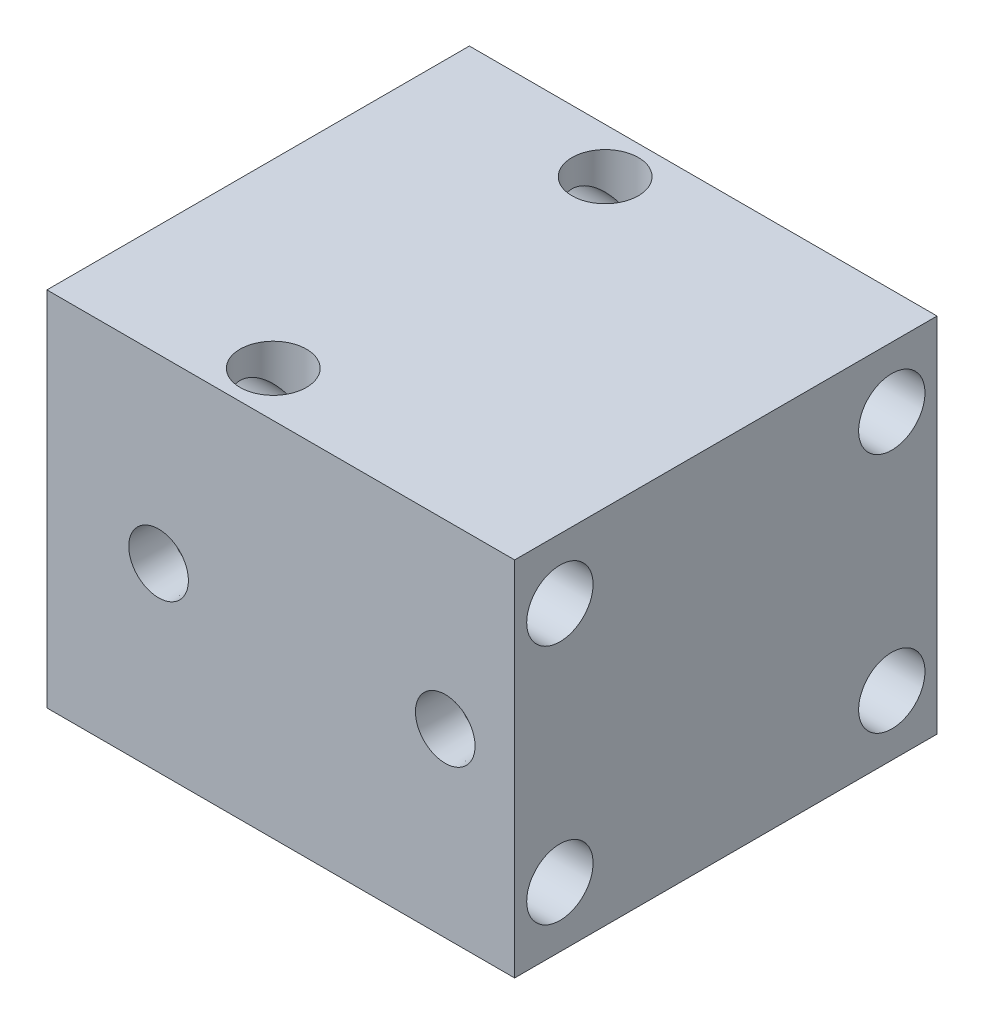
ISO-10303-21;
HEADER;
FILE_DESCRIPTION(('STEP AP214'),'2;1');
FILE_NAME('part.step','',(''),(''),'','','');
FILE_SCHEMA(('AUTOMOTIVE_DESIGN { 1 0 10303 214 1 1 1 1 }'));
ENDSEC;
DATA;
#1=APPLICATION_CONTEXT('core data for automotive mechanical design processes');
#2=APPLICATION_PROTOCOL_DEFINITION('international standard','automotive_design',2000,#1);
#3=PRODUCT_CONTEXT('',#1,'mechanical');
#4=PRODUCT('Part','Part','',(#3));
#5=PRODUCT_RELATED_PRODUCT_CATEGORY('part','',(#4));
#6=PRODUCT_DEFINITION_FORMATION('','',#4);
#7=PRODUCT_DEFINITION_CONTEXT('part definition',#1,'design');
#8=PRODUCT_DEFINITION('design','',#6,#7);
#9=PRODUCT_DEFINITION_SHAPE('','',#8);
#10=(LENGTH_UNIT() NAMED_UNIT(*) SI_UNIT(.MILLI.,.METRE.));
#11=(NAMED_UNIT(*) PLANE_ANGLE_UNIT() SI_UNIT($,.RADIAN.));
#12=(NAMED_UNIT(*) SI_UNIT($,.STERADIAN.) SOLID_ANGLE_UNIT());
#13=UNCERTAINTY_MEASURE_WITH_UNIT(LENGTH_MEASURE(1.E-05),#10,'distance_accuracy_value','');
#14=(GEOMETRIC_REPRESENTATION_CONTEXT(3) GLOBAL_UNCERTAINTY_ASSIGNED_CONTEXT((#13)) GLOBAL_UNIT_ASSIGNED_CONTEXT((#10,
#11,#12)) REPRESENTATION_CONTEXT('',''));
#15=CARTESIAN_POINT('',(0.,0.,0.));
#16=DIRECTION('',(0.,0.,1.));
#17=DIRECTION('',(1.,0.,0.));
#18=AXIS2_PLACEMENT_3D('',#15,#16,#17);
#19=CARTESIAN_POINT('',(-17.5,120.,55.));
#20=DIRECTION('',(0.,-1.,0.));
#21=DIRECTION('',(0.,0.,-1.));
#22=AXIS2_PLACEMENT_3D('',#19,#20,#21);
#23=CYLINDRICAL_SURFACE('',#22,11.);
#24=CARTESIAN_POINT('',(-17.5,20.,55.));
#25=DIRECTION('',(-0.707106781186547,-0.707106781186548,0.));
#26=DIRECTION('',(0.707106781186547,-0.707106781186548,0.));
#27=AXIS2_PLACEMENT_3D('',#24,#25,#26);
#28=ELLIPSE('',#27,15.556349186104,11.);
#29=CARTESIAN_POINT('',(-17.5,20.,44.));
#30=VERTEX_POINT('',#29);
#31=CARTESIAN_POINT('',(-17.5,20.,66.));
#32=VERTEX_POINT('',#31);
#33=EDGE_CURVE('E11',#30,#32,#28,.F.);
#34=ORIENTED_EDGE('',*,*,#33,.F.);
#35=CARTESIAN_POINT('',(-17.5,20.,55.));
#36=DIRECTION('',(0.707106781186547,-0.707106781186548,0.));
#37=DIRECTION('',(-0.707106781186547,-0.707106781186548,0.));
#38=AXIS2_PLACEMENT_3D('',#35,#36,#37);
#39=ELLIPSE('',#38,15.556349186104,11.);
#40=EDGE_CURVE('E51',#32,#30,#39,.F.);
#41=ORIENTED_EDGE('',*,*,#40,.F.);
#42=EDGE_LOOP('',(#34,#41));
#43=FACE_BOUND('',#42,.T.);
#44=CARTESIAN_POINT('',(-17.5,100.,55.));
#45=DIRECTION('',(-0.707106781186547,-0.707106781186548,0.));
#46=DIRECTION('',(0.707106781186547,-0.707106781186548,0.));
#47=AXIS2_PLACEMENT_3D('',#44,#45,#46);
#48=ELLIPSE('',#47,15.556349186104,11.);
#49=CARTESIAN_POINT('',(-17.5,100.,44.));
#50=VERTEX_POINT('',#49);
#51=CARTESIAN_POINT('',(-17.5,100.,66.));
#52=VERTEX_POINT('',#51);
#53=EDGE_CURVE('E252',#50,#52,#48,.T.);
#54=ORIENTED_EDGE('',*,*,#53,.F.);
#55=CARTESIAN_POINT('',(-17.5,100.,55.));
#56=DIRECTION('',(0.707106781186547,-0.707106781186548,0.));
#57=DIRECTION('',(-0.707106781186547,-0.707106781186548,0.));
#58=AXIS2_PLACEMENT_3D('',#55,#56,#57);
#59=ELLIPSE('',#58,15.556349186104,11.);
#60=EDGE_CURVE('E250',#52,#50,#59,.T.);
#61=ORIENTED_EDGE('',*,*,#60,.F.);
#62=EDGE_LOOP('',(#54,#61));
#63=FACE_BOUND('',#62,.T.);
#64=ADVANCED_FACE('F35',(#43,#63),#23,.F.);
#65=CARTESIAN_POINT('',(-17.5,100.,55.));
#66=DIRECTION('',(-0.707106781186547,-0.707106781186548,0.));
#67=DIRECTION('',(0.707106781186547,-0.707106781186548,0.));
#68=AXIS2_PLACEMENT_3D('',#65,#66,#67);
#69=ELLIPSE('',#68,15.556349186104,11.);
#70=EDGE_CURVE('E112',#50,#52,#69,.F.);
#71=ORIENTED_EDGE('',*,*,#70,.F.);
#72=CARTESIAN_POINT('',(-17.5,100.,55.));
#73=DIRECTION('',(0.707106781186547,-0.707106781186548,0.));
#74=DIRECTION('',(-0.707106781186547,-0.707106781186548,0.));
#75=AXIS2_PLACEMENT_3D('',#72,#73,#74);
#76=ELLIPSE('',#75,15.556349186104,11.);
#77=EDGE_CURVE('E58',#52,#50,#76,.F.);
#78=ORIENTED_EDGE('',*,*,#77,.F.);
#79=EDGE_LOOP('',(#71,#78));
#80=FACE_BOUND('',#79,.T.);
#81=CARTESIAN_POINT('',(-17.5,120.,55.));
#82=DIRECTION('',(0.,1.,0.));
#83=DIRECTION('',(0.,0.,1.));
#84=AXIS2_PLACEMENT_3D('',#81,#82,#83);
#85=CIRCLE('',#84,11.);
#86=CARTESIAN_POINT('',(-17.5,120.,66.));
#87=VERTEX_POINT('',#86);
#88=EDGE_CURVE('E186',#87,#87,#85,.T.);
#89=ORIENTED_EDGE('',*,*,#88,.T.);
#90=EDGE_LOOP('',(#89));
#91=FACE_BOUND('',#90,.T.);
#92=ADVANCED_FACE('F307',(#80,#91),#23,.F.);
#93=CARTESIAN_POINT('',(-17.5,120.,-55.));
#94=DIRECTION('',(0.,-1.,0.));
#95=DIRECTION('',(0.,0.,-1.));
#96=AXIS2_PLACEMENT_3D('',#93,#94,#95);
#97=CYLINDRICAL_SURFACE('',#96,11.);
#98=CARTESIAN_POINT('',(-17.5,20.,-55.));
#99=DIRECTION('',(-0.707106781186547,-0.707106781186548,0.));
#100=DIRECTION('',(0.707106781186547,-0.707106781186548,0.));
#101=AXIS2_PLACEMENT_3D('',#98,#99,#100);
#102=ELLIPSE('',#101,15.556349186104,11.);
#103=CARTESIAN_POINT('',(-17.5,20.,-66.));
#104=VERTEX_POINT('',#103);
#105=CARTESIAN_POINT('',(-17.5,20.,-44.));
#106=VERTEX_POINT('',#105);
#107=EDGE_CURVE('E246',#104,#106,#102,.F.);
#108=ORIENTED_EDGE('',*,*,#107,.F.);
#109=CARTESIAN_POINT('',(-17.5,20.,-55.));
#110=DIRECTION('',(0.707106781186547,-0.707106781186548,0.));
#111=DIRECTION('',(-0.707106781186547,-0.707106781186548,0.));
#112=AXIS2_PLACEMENT_3D('',#109,#110,#111);
#113=ELLIPSE('',#112,15.556349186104,11.);
#114=EDGE_CURVE('E238',#106,#104,#113,.F.);
#115=ORIENTED_EDGE('',*,*,#114,.F.);
#116=EDGE_LOOP('',(#108,#115));
#117=FACE_BOUND('',#116,.T.);
#118=CARTESIAN_POINT('',(-17.5,100.,-55.));
#119=DIRECTION('',(-0.707106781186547,-0.707106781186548,0.));
#120=DIRECTION('',(0.707106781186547,-0.707106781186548,0.));
#121=AXIS2_PLACEMENT_3D('',#118,#119,#120);
#122=ELLIPSE('',#121,15.556349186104,11.);
#123=CARTESIAN_POINT('',(-17.5,100.,-66.));
#124=VERTEX_POINT('',#123);
#125=CARTESIAN_POINT('',(-17.5,100.,-44.));
#126=VERTEX_POINT('',#125);
#127=EDGE_CURVE('E232',#124,#126,#122,.T.);
#128=ORIENTED_EDGE('',*,*,#127,.F.);
#129=CARTESIAN_POINT('',(-17.5,100.,-55.));
#130=DIRECTION('',(0.707106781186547,-0.707106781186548,0.));
#131=DIRECTION('',(-0.707106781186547,-0.707106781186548,0.));
#132=AXIS2_PLACEMENT_3D('',#129,#130,#131);
#133=ELLIPSE('',#132,15.556349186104,11.);
#134=EDGE_CURVE('E230',#126,#124,#133,.T.);
#135=ORIENTED_EDGE('',*,*,#134,.F.);
#136=EDGE_LOOP('',(#128,#135));
#137=FACE_BOUND('',#136,.T.);
#138=ADVANCED_FACE('F312',(#117,#137),#97,.F.);
#139=CARTESIAN_POINT('',(-17.5,100.,-55.));
#140=DIRECTION('',(-0.707106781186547,-0.707106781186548,0.));
#141=DIRECTION('',(0.707106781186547,-0.707106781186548,0.));
#142=AXIS2_PLACEMENT_3D('',#139,#140,#141);
#143=ELLIPSE('',#142,15.556349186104,11.);
#144=EDGE_CURVE('E235',#124,#126,#143,.F.);
#145=ORIENTED_EDGE('',*,*,#144,.F.);
#146=CARTESIAN_POINT('',(-17.5,100.,-55.));
#147=DIRECTION('',(0.707106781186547,-0.707106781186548,0.));
#148=DIRECTION('',(-0.707106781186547,-0.707106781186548,0.));
#149=AXIS2_PLACEMENT_3D('',#146,#147,#148);
#150=ELLIPSE('',#149,15.556349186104,11.);
#151=EDGE_CURVE('E227',#126,#124,#150,.F.);
#152=ORIENTED_EDGE('',*,*,#151,.F.);
#153=EDGE_LOOP('',(#145,#152));
#154=FACE_BOUND('',#153,.T.);
#155=CARTESIAN_POINT('',(-17.5,120.,-55.));
#156=DIRECTION('',(0.,1.,0.));
#157=DIRECTION('',(0.,0.,1.));
#158=AXIS2_PLACEMENT_3D('',#155,#156,#157);
#159=CIRCLE('',#158,11.);
#160=CARTESIAN_POINT('',(-17.5,120.,-44.));
#161=VERTEX_POINT('',#160);
#162=EDGE_CURVE('E192',#161,#161,#159,.T.);
#163=ORIENTED_EDGE('',*,*,#162,.T.);
#164=EDGE_LOOP('',(#163));
#165=FACE_BOUND('',#164,.T.);
#166=ADVANCED_FACE('F325',(#154,#165),#97,.F.);
#167=CARTESIAN_POINT('',(-77.5,120.,70.));
#168=DIRECTION('',(0.,1.,0.));
#169=DIRECTION('',(0.,0.,1.));
#170=AXIS2_PLACEMENT_3D('',#167,#168,#169);
#171=PLANE('',#170);
#172=ORIENTED_EDGE('',*,*,#162,.F.);
#173=EDGE_LOOP('',(#172));
#174=FACE_BOUND('',#173,.T.);
#175=DIRECTION('',(0.,0.,1.));
#176=VECTOR('',#175,1.);
#177=CARTESIAN_POINT('',(-77.5,120.,-70.));
#178=LINE('',#177,#176);
#179=CARTESIAN_POINT('',(-77.5,120.,-70.));
#180=VERTEX_POINT('',#179);
#181=CARTESIAN_POINT('',(-77.5,120.,70.));
#182=VERTEX_POINT('',#181);
#183=EDGE_CURVE('E198',#180,#182,#178,.T.);
#184=ORIENTED_EDGE('',*,*,#183,.T.);
#185=DIRECTION('',(1.,0.,0.));
#186=VECTOR('',#185,1.);
#187=CARTESIAN_POINT('',(-77.5,120.,70.));
#188=LINE('',#187,#186);
#189=CARTESIAN_POINT('',(77.5,120.,70.));
#190=VERTEX_POINT('',#189);
#191=EDGE_CURVE('E201',#182,#190,#188,.T.);
#192=ORIENTED_EDGE('',*,*,#191,.T.);
#193=DIRECTION('',(0.,0.,-1.));
#194=VECTOR('',#193,1.);
#195=CARTESIAN_POINT('',(77.5,120.,-70.));
#196=LINE('',#195,#194);
#197=CARTESIAN_POINT('',(77.5,120.,-70.));
#198=VERTEX_POINT('',#197);
#199=EDGE_CURVE('E204',#190,#198,#196,.T.);
#200=ORIENTED_EDGE('',*,*,#199,.T.);
#201=DIRECTION('',(-1.,0.,0.));
#202=VECTOR('',#201,1.);
#203=CARTESIAN_POINT('',(-77.5,120.,-70.));
#204=LINE('',#203,#202);
#205=EDGE_CURVE('E206',#198,#180,#204,.T.);
#206=ORIENTED_EDGE('',*,*,#205,.T.);
#207=EDGE_LOOP('',(#184,#192,#200,#206));
#208=FACE_BOUND('',#207,.T.);
#209=ORIENTED_EDGE('',*,*,#88,.F.);
#210=EDGE_LOOP('',(#209));
#211=FACE_BOUND('',#210,.T.);
#212=ADVANCED_FACE('F295',(#174,#208,#211),#171,.T.);
#213=CARTESIAN_POINT('',(-77.5,0.,70.));
#214=DIRECTION('',(0.,1.,0.));
#215=DIRECTION('',(0.,0.,1.));
#216=AXIS2_PLACEMENT_3D('',#213,#214,#215);
#217=PLANE('',#216);
#218=CARTESIAN_POINT('',(-17.5,0.,-55.));
#219=DIRECTION('',(0.,1.,0.));
#220=DIRECTION('',(0.,0.,1.));
#221=AXIS2_PLACEMENT_3D('',#218,#219,#220);
#222=CIRCLE('',#221,11.);
#223=CARTESIAN_POINT('',(-17.5,0.,-44.));
#224=VERTEX_POINT('',#223);
#225=EDGE_CURVE('E189',#224,#224,#222,.T.);
#226=ORIENTED_EDGE('',*,*,#225,.T.);
#227=EDGE_LOOP('',(#226));
#228=FACE_BOUND('',#227,.T.);
#229=DIRECTION('',(0.,0.,1.));
#230=VECTOR('',#229,1.);
#231=CARTESIAN_POINT('',(-77.5,0.,-70.));
#232=LINE('',#231,#230);
#233=CARTESIAN_POINT('',(-77.5,0.,-70.));
#234=VERTEX_POINT('',#233);
#235=CARTESIAN_POINT('',(-77.5,0.,70.));
#236=VERTEX_POINT('',#235);
#237=EDGE_CURVE('E195',#234,#236,#232,.T.);
#238=ORIENTED_EDGE('',*,*,#237,.F.);
#239=DIRECTION('',(-1.,0.,0.));
#240=VECTOR('',#239,1.);
#241=CARTESIAN_POINT('',(-77.5,0.,-70.));
#242=LINE('',#241,#240);
#243=CARTESIAN_POINT('',(77.5,0.,-70.));
#244=VERTEX_POINT('',#243);
#245=EDGE_CURVE('E202',#244,#234,#242,.T.);
#246=ORIENTED_EDGE('',*,*,#245,.F.);
#247=DIRECTION('',(0.,0.,-1.));
#248=VECTOR('',#247,1.);
#249=CARTESIAN_POINT('',(77.5,0.,-70.));
#250=LINE('',#249,#248);
#251=CARTESIAN_POINT('',(77.5,0.,70.));
#252=VERTEX_POINT('',#251);
#253=EDGE_CURVE('E213',#252,#244,#250,.T.);
#254=ORIENTED_EDGE('',*,*,#253,.F.);
#255=DIRECTION('',(1.,0.,0.));
#256=VECTOR('',#255,1.);
#257=CARTESIAN_POINT('',(-77.5,0.,70.));
#258=LINE('',#257,#256);
#259=EDGE_CURVE('E211',#236,#252,#258,.T.);
#260=ORIENTED_EDGE('',*,*,#259,.F.);
#261=EDGE_LOOP('',(#238,#246,#254,#260));
#262=FACE_BOUND('',#261,.T.);
#263=CARTESIAN_POINT('',(-17.5,0.,55.));
#264=DIRECTION('',(0.,1.,0.));
#265=DIRECTION('',(0.,0.,1.));
#266=AXIS2_PLACEMENT_3D('',#263,#264,#265);
#267=CIRCLE('',#266,11.);
#268=CARTESIAN_POINT('',(-17.5,0.,66.));
#269=VERTEX_POINT('',#268);
#270=EDGE_CURVE('E183',#269,#269,#267,.T.);
#271=ORIENTED_EDGE('',*,*,#270,.T.);
#272=EDGE_LOOP('',(#271));
#273=FACE_BOUND('',#272,.T.);
#274=ADVANCED_FACE('F289',(#228,#262,#273),#217,.F.);
#275=CARTESIAN_POINT('',(-77.5,120.,-70.));
#276=DIRECTION('',(1.,0.,0.));
#277=DIRECTION('',(0.,0.,-1.));
#278=AXIS2_PLACEMENT_3D('',#275,#276,#277);
#279=PLANE('',#278);
#280=CARTESIAN_POINT('',(-77.5,20.,55.));
#281=DIRECTION('',(-1.,0.,0.));
#282=DIRECTION('',(0.,0.,1.));
#283=AXIS2_PLACEMENT_3D('',#280,#281,#282);
#284=CIRCLE('',#283,11.);
#285=CARTESIAN_POINT('',(-77.5,20.,66.));
#286=VERTEX_POINT('',#285);
#287=EDGE_CURVE('E120',#286,#286,#284,.T.);
#288=ORIENTED_EDGE('',*,*,#287,.F.);
#289=EDGE_LOOP('',(#288));
#290=FACE_BOUND('',#289,.T.);
#291=CARTESIAN_POINT('',(-77.5,100.,55.));
#292=DIRECTION('',(-1.,0.,0.));
#293=DIRECTION('',(0.,0.,1.));
#294=AXIS2_PLACEMENT_3D('',#291,#292,#293);
#295=CIRCLE('',#294,11.);
#296=CARTESIAN_POINT('',(-77.5,100.,66.));
#297=VERTEX_POINT('',#296);
#298=EDGE_CURVE('E137',#297,#297,#295,.T.);
#299=ORIENTED_EDGE('',*,*,#298,.F.);
#300=EDGE_LOOP('',(#299));
#301=FACE_BOUND('',#300,.T.);
#302=CARTESIAN_POINT('',(-77.5,20.,-55.));
#303=DIRECTION('',(-1.,0.,0.));
#304=DIRECTION('',(0.,0.,1.));
#305=AXIS2_PLACEMENT_3D('',#302,#303,#304);
#306=CIRCLE('',#305,11.);
#307=CARTESIAN_POINT('',(-77.5,20.,-44.));
#308=VERTEX_POINT('',#307);
#309=EDGE_CURVE('E143',#308,#308,#306,.T.);
#310=ORIENTED_EDGE('',*,*,#309,.F.);
#311=EDGE_LOOP('',(#310));
#312=FACE_BOUND('',#311,.T.);
#313=CARTESIAN_POINT('',(-77.5,100.,-55.));
#314=DIRECTION('',(-1.,0.,0.));
#315=DIRECTION('',(0.,0.,1.));
#316=AXIS2_PLACEMENT_3D('',#313,#314,#315);
#317=CIRCLE('',#316,11.);
#318=CARTESIAN_POINT('',(-77.5,100.,-44.));
#319=VERTEX_POINT('',#318);
#320=EDGE_CURVE('E149',#319,#319,#317,.T.);
#321=ORIENTED_EDGE('',*,*,#320,.F.);
#322=EDGE_LOOP('',(#321));
#323=FACE_BOUND('',#322,.T.);
#324=CARTESIAN_POINT('',(-77.5,60.,0.));
#325=DIRECTION('',(-1.,0.,0.));
#326=DIRECTION('',(0.,0.,1.));
#327=AXIS2_PLACEMENT_3D('',#324,#325,#326);
#328=CIRCLE('',#327,1.5);
#329=CARTESIAN_POINT('',(-77.5,60.,1.5));
#330=VERTEX_POINT('',#329);
#331=EDGE_CURVE('E179',#330,#330,#328,.T.);
#332=ORIENTED_EDGE('',*,*,#331,.F.);
#333=EDGE_LOOP('',(#332));
#334=FACE_BOUND('',#333,.T.);
#335=ORIENTED_EDGE('',*,*,#237,.T.);
#336=DIRECTION('',(0.,-1.,0.));
#337=VECTOR('',#336,1.);
#338=CARTESIAN_POINT('',(-77.5,120.,70.));
#339=LINE('',#338,#337);
#340=EDGE_CURVE('E224',#182,#236,#339,.T.);
#341=ORIENTED_EDGE('',*,*,#340,.F.);
#342=ORIENTED_EDGE('',*,*,#183,.F.);
#343=DIRECTION('',(0.,-1.,0.));
#344=VECTOR('',#343,1.);
#345=CARTESIAN_POINT('',(-77.5,120.,-70.));
#346=LINE('',#345,#344);
#347=EDGE_CURVE('E208',#180,#234,#346,.T.);
#348=ORIENTED_EDGE('',*,*,#347,.T.);
#349=EDGE_LOOP('',(#335,#341,#342,#348));
#350=FACE_BOUND('',#349,.T.);
#351=ADVANCED_FACE('F37',(#290,#301,#312,#323,#334,#350),#279,.F.);
#352=CARTESIAN_POINT('',(-77.5,120.,70.));
#353=DIRECTION('',(0.,0.,-1.));
#354=DIRECTION('',(-1.,0.,0.));
#355=AXIS2_PLACEMENT_3D('',#352,#353,#354);
#356=PLANE('',#355);
#357=CARTESIAN_POINT('',(54.5,60.,70.));
#358=DIRECTION('',(0.,0.,1.));
#359=DIRECTION('',(1.,0.,0.));
#360=AXIS2_PLACEMENT_3D('',#357,#358,#359);
#361=CIRCLE('',#360,9.8860229);
#362=CARTESIAN_POINT('',(64.3860229,60.,70.));
#363=VERTEX_POINT('',#362);
#364=EDGE_CURVE('E155',#363,#363,#361,.T.);
#365=ORIENTED_EDGE('',*,*,#364,.F.);
#366=EDGE_LOOP('',(#365));
#367=FACE_BOUND('',#366,.T.);
#368=CARTESIAN_POINT('',(-40.5,60.,70.));
#369=DIRECTION('',(0.,0.,1.));
#370=DIRECTION('',(1.,0.,0.));
#371=AXIS2_PLACEMENT_3D('',#368,#369,#370);
#372=CIRCLE('',#371,9.8860229);
#373=CARTESIAN_POINT('',(-30.6139771,60.,70.));
#374=VERTEX_POINT('',#373);
#375=EDGE_CURVE('E167',#374,#374,#372,.T.);
#376=ORIENTED_EDGE('',*,*,#375,.F.);
#377=EDGE_LOOP('',(#376));
#378=FACE_BOUND('',#377,.T.);
#379=ORIENTED_EDGE('',*,*,#259,.T.);
#380=DIRECTION('',(0.,-1.,0.));
#381=VECTOR('',#380,1.);
#382=CARTESIAN_POINT('',(77.5,120.,70.));
#383=LINE('',#382,#381);
#384=EDGE_CURVE('E221',#190,#252,#383,.T.);
#385=ORIENTED_EDGE('',*,*,#384,.F.);
#386=ORIENTED_EDGE('',*,*,#191,.F.);
#387=ORIENTED_EDGE('',*,*,#340,.T.);
#388=EDGE_LOOP('',(#379,#385,#386,#387));
#389=FACE_BOUND('',#388,.T.);
#390=ADVANCED_FACE('F272',(#367,#378,#389),#356,.F.);
#391=CARTESIAN_POINT('',(77.5,120.,-70.));
#392=DIRECTION('',(-1.,0.,0.));
#393=DIRECTION('',(0.,0.,1.));
#394=AXIS2_PLACEMENT_3D('',#391,#392,#393);
#395=PLANE('',#394);
#396=CARTESIAN_POINT('',(77.5,20.,55.));
#397=DIRECTION('',(-1.,0.,0.));
#398=DIRECTION('',(0.,0.,1.));
#399=AXIS2_PLACEMENT_3D('',#396,#397,#398);
#400=CIRCLE('',#399,11.);
#401=CARTESIAN_POINT('',(77.5,20.,66.));
#402=VERTEX_POINT('',#401);
#403=EDGE_CURVE('E125',#402,#402,#400,.F.);
#404=ORIENTED_EDGE('',*,*,#403,.F.);
#405=EDGE_LOOP('',(#404));
#406=FACE_BOUND('',#405,.T.);
#407=CARTESIAN_POINT('',(77.5,100.,55.));
#408=DIRECTION('',(-1.,0.,0.));
#409=DIRECTION('',(0.,0.,1.));
#410=AXIS2_PLACEMENT_3D('',#407,#408,#409);
#411=CIRCLE('',#410,11.);
#412=CARTESIAN_POINT('',(77.5,100.,66.));
#413=VERTEX_POINT('',#412);
#414=EDGE_CURVE('E140',#413,#413,#411,.F.);
#415=ORIENTED_EDGE('',*,*,#414,.F.);
#416=EDGE_LOOP('',(#415));
#417=FACE_BOUND('',#416,.T.);
#418=CARTESIAN_POINT('',(77.5,20.,-55.));
#419=DIRECTION('',(-1.,0.,0.));
#420=DIRECTION('',(0.,0.,1.));
#421=AXIS2_PLACEMENT_3D('',#418,#419,#420);
#422=CIRCLE('',#421,11.);
#423=CARTESIAN_POINT('',(77.5,20.,-44.));
#424=VERTEX_POINT('',#423);
#425=EDGE_CURVE('E146',#424,#424,#422,.F.);
#426=ORIENTED_EDGE('',*,*,#425,.F.);
#427=EDGE_LOOP('',(#426));
#428=FACE_BOUND('',#427,.T.);
#429=CARTESIAN_POINT('',(77.5,100.,-55.));
#430=DIRECTION('',(-1.,0.,0.));
#431=DIRECTION('',(0.,0.,1.));
#432=AXIS2_PLACEMENT_3D('',#429,#430,#431);
#433=CIRCLE('',#432,11.);
#434=CARTESIAN_POINT('',(77.5,100.,-44.));
#435=VERTEX_POINT('',#434);
#436=EDGE_CURVE('E152',#435,#435,#433,.F.);
#437=ORIENTED_EDGE('',*,*,#436,.F.);
#438=EDGE_LOOP('',(#437));
#439=FACE_BOUND('',#438,.T.);
#440=ORIENTED_EDGE('',*,*,#253,.T.);
#441=DIRECTION('',(0.,-1.,0.));
#442=VECTOR('',#441,1.);
#443=CARTESIAN_POINT('',(77.5,120.,-70.));
#444=LINE('',#443,#442);
#445=EDGE_CURVE('E218',#198,#244,#444,.T.);
#446=ORIENTED_EDGE('',*,*,#445,.F.);
#447=ORIENTED_EDGE('',*,*,#199,.F.);
#448=ORIENTED_EDGE('',*,*,#384,.T.);
#449=EDGE_LOOP('',(#440,#446,#447,#448));
#450=FACE_BOUND('',#449,.T.);
#451=ADVANCED_FACE('F268',(#406,#417,#428,#439,#450),#395,.F.);
#452=CARTESIAN_POINT('',(-77.5,120.,-70.));
#453=DIRECTION('',(0.,0.,1.));
#454=DIRECTION('',(1.,0.,0.));
#455=AXIS2_PLACEMENT_3D('',#452,#453,#454);
#456=PLANE('',#455);
#457=ORIENTED_EDGE('',*,*,#245,.T.);
#458=ORIENTED_EDGE('',*,*,#347,.F.);
#459=ORIENTED_EDGE('',*,*,#205,.F.);
#460=ORIENTED_EDGE('',*,*,#445,.T.);
#461=EDGE_LOOP('',(#457,#458,#459,#460));
#462=FACE_BOUND('',#461,.T.);
#463=ADVANCED_FACE('F271',(#462),#456,.F.);
#464=CARTESIAN_POINT('',(-17.5,20.,-55.));
#465=DIRECTION('',(-0.707106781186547,-0.707106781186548,0.));
#466=DIRECTION('',(0.707106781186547,-0.707106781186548,0.));
#467=AXIS2_PLACEMENT_3D('',#464,#465,#466);
#468=ELLIPSE('',#467,15.556349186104,11.);
#469=EDGE_CURVE('E243',#104,#106,#468,.T.);
#470=ORIENTED_EDGE('',*,*,#469,.F.);
#471=CARTESIAN_POINT('',(-17.5,20.,-55.));
#472=DIRECTION('',(0.707106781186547,-0.707106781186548,0.));
#473=DIRECTION('',(-0.707106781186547,-0.707106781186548,0.));
#474=AXIS2_PLACEMENT_3D('',#471,#472,#473);
#475=ELLIPSE('',#474,15.556349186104,11.);
#476=EDGE_CURVE('E241',#106,#104,#475,.T.);
#477=ORIENTED_EDGE('',*,*,#476,.F.);
#478=EDGE_LOOP('',(#470,#477));
#479=FACE_BOUND('',#478,.T.);
#480=ORIENTED_EDGE('',*,*,#225,.F.);
#481=EDGE_LOOP('',(#480));
#482=FACE_BOUND('',#481,.T.);
#483=ADVANCED_FACE('F317',(#479,#482),#97,.F.);
#484=CARTESIAN_POINT('',(-17.5,20.,55.));
#485=DIRECTION('',(-0.707106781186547,-0.707106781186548,0.));
#486=DIRECTION('',(0.707106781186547,-0.707106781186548,0.));
#487=AXIS2_PLACEMENT_3D('',#484,#485,#486);
#488=ELLIPSE('',#487,15.556349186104,11.);
#489=EDGE_CURVE('E44',#30,#32,#488,.T.);
#490=ORIENTED_EDGE('',*,*,#489,.F.);
#491=CARTESIAN_POINT('',(-17.5,20.,55.));
#492=DIRECTION('',(0.707106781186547,-0.707106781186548,0.));
#493=DIRECTION('',(-0.707106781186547,-0.707106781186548,0.));
#494=AXIS2_PLACEMENT_3D('',#491,#492,#493);
#495=ELLIPSE('',#494,15.556349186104,11.);
#496=EDGE_CURVE('E103',#32,#30,#495,.T.);
#497=ORIENTED_EDGE('',*,*,#496,.F.);
#498=EDGE_LOOP('',(#490,#497));
#499=FACE_BOUND('',#498,.T.);
#500=ORIENTED_EDGE('',*,*,#270,.F.);
#501=EDGE_LOOP('',(#500));
#502=FACE_BOUND('',#501,.T.);
#503=ADVANCED_FACE('F115',(#499,#502),#23,.F.);
#504=CARTESIAN_POINT('',(-17.5,60.,0.));
#505=DIRECTION('',(-1.,0.,0.));
#506=DIRECTION('',(0.,0.,1.));
#507=AXIS2_PLACEMENT_3D('',#504,#505,#506);
#508=CYLINDRICAL_SURFACE('',#507,1.5);
#509=CARTESIAN_POINT('',(-17.5,60.,0.));
#510=DIRECTION('',(-1.,0.,0.));
#511=DIRECTION('',(0.,0.,1.));
#512=AXIS2_PLACEMENT_3D('',#509,#510,#511);
#513=CIRCLE('',#512,1.5);
#514=CARTESIAN_POINT('',(-17.5,60.,1.49999999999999));
#515=VERTEX_POINT('',#514);
#516=EDGE_CURVE('E180',#515,#515,#513,.T.);
#517=ORIENTED_EDGE('',*,*,#516,.F.);
#518=EDGE_LOOP('',(#517));
#519=FACE_BOUND('',#518,.T.);
#520=ORIENTED_EDGE('',*,*,#331,.T.);
#521=EDGE_LOOP('',(#520));
#522=FACE_BOUND('',#521,.T.);
#523=ADVANCED_FACE('F316',(#519,#522),#508,.F.);
#524=CARTESIAN_POINT('',(-17.5,60.,0.));
#525=DIRECTION('',(-1.,0.,0.));
#526=DIRECTION('',(0.,0.,1.));
#527=AXIS2_PLACEMENT_3D('',#524,#525,#526);
#528=PLANE('',#527);
#529=ORIENTED_EDGE('',*,*,#516,.T.);
#530=EDGE_LOOP('',(#529));
#531=FACE_BOUND('',#530,.T.);
#532=ADVANCED_FACE('F322',(#531),#528,.T.);
#533=CARTESIAN_POINT('',(-40.5,60.,47.36));
#534=DIRECTION('',(0.,0.,1.));
#535=DIRECTION('',(1.,0.,0.));
#536=AXIS2_PLACEMENT_3D('',#533,#534,#535);
#537=CONICAL_SURFACE('',#536,8.92809999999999,1.02974425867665);
#538=CARTESIAN_POINT('',(-40.5,60.,43.1971775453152));
#539=DIRECTION('',(0.,0.,1.));
#540=DIRECTION('',(1.,0.,0.));
#541=AXIS2_PLACEMENT_3D('',#538,#539,#540);
#542=CIRCLE('',#541,2.00000000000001);
#543=CARTESIAN_POINT('',(-38.5,60.,43.1971775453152));
#544=VERTEX_POINT('',#543);
#545=EDGE_CURVE('E118',#544,#544,#542,.F.);
#546=CARTESIAN_POINT('',(-40.5,60.,47.36));
#547=DIRECTION('',(0.,0.,1.));
#548=DIRECTION('',(1.,0.,0.));
#549=AXIS2_PLACEMENT_3D('',#546,#547,#548);
#550=CIRCLE('',#549,8.92809999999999);
#551=CARTESIAN_POINT('',(-31.5719,60.,47.36));
#552=VERTEX_POINT('',#551);
#553=EDGE_CURVE('E176',#552,#552,#550,.T.);
#554=CARTESIAN_POINT('',(-38.5,60.,43.1971775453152));
#555=CARTESIAN_POINT('',(-38.4278322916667,60.,43.2405402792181));
#556=CARTESIAN_POINT('',(-38.3556645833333,60.,43.2839030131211));
#557=CARTESIAN_POINT('',(-38.2113291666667,60.,43.370628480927));
#558=CARTESIAN_POINT('',(-38.1391614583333,60.,43.41399121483));
#559=CARTESIAN_POINT('',(-37.9948260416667,60.,43.5007166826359));
#560=CARTESIAN_POINT('',(-37.9226583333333,60.,43.5440794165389));
#561=CARTESIAN_POINT('',(-37.7783229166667,60.,43.6308048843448));
#562=CARTESIAN_POINT('',(-37.7061552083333,60.,43.6741676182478));
#563=CARTESIAN_POINT('',(-37.5618197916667,60.,43.7608930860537));
#564=CARTESIAN_POINT('',(-37.4896520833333,60.,43.8042558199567));
#565=CARTESIAN_POINT('',(-37.3453166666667,60.,43.8909812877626));
#566=CARTESIAN_POINT('',(-37.2731489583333,60.,43.9343440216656));
#567=CARTESIAN_POINT('',(-37.1288135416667,60.,44.0210694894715));
#568=CARTESIAN_POINT('',(-37.0566458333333,60.,44.0644322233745));
#569=CARTESIAN_POINT('',(-36.9123104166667,60.,44.1511576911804));
#570=CARTESIAN_POINT('',(-36.8401427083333,60.,44.1945204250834));
#571=CARTESIAN_POINT('',(-36.6958072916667,60.,44.2812458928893));
#572=CARTESIAN_POINT('',(-36.6236395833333,60.,44.3246086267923));
#573=CARTESIAN_POINT('',(-36.4793041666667,60.,44.4113340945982));
#574=CARTESIAN_POINT('',(-36.4071364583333,60.,44.4546968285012));
#575=CARTESIAN_POINT('',(-36.2628010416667,60.,44.5414222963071));
#576=CARTESIAN_POINT('',(-36.1906333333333,60.,44.5847850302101));
#577=CARTESIAN_POINT('',(-36.0462979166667,60.,44.671510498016));
#578=CARTESIAN_POINT('',(-35.9741302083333,60.,44.714873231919));
#579=CARTESIAN_POINT('',(-35.8297947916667,60.,44.8015986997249));
#580=CARTESIAN_POINT('',(-35.7576270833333,60.,44.8449614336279));
#581=CARTESIAN_POINT('',(-35.6132916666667,60.,44.9316869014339));
#582=CARTESIAN_POINT('',(-35.5411239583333,60.,44.9750496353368));
#583=CARTESIAN_POINT('',(-35.3967885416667,60.,45.0617751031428));
#584=CARTESIAN_POINT('',(-35.3246208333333,60.,45.1051378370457));
#585=CARTESIAN_POINT('',(-35.1802854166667,60.,45.1918633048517));
#586=CARTESIAN_POINT('',(-35.1081177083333,60.,45.2352260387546));
#587=CARTESIAN_POINT('',(-34.9637822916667,60.,45.3219515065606));
#588=CARTESIAN_POINT('',(-34.8916145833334,60.,45.3653142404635));
#589=CARTESIAN_POINT('',(-34.7472791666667,60.,45.4520397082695));
#590=CARTESIAN_POINT('',(-34.6751114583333,60.,45.4954024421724));
#591=CARTESIAN_POINT('',(-34.5307760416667,60.,45.5821279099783));
#592=CARTESIAN_POINT('',(-34.4586083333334,60.,45.6254906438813));
#593=CARTESIAN_POINT('',(-34.3142729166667,60.,45.7122161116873));
#594=CARTESIAN_POINT('',(-34.2421052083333,60.,45.7555788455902));
#595=CARTESIAN_POINT('',(-34.0977697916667,60.,45.8423043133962));
#596=CARTESIAN_POINT('',(-34.0256020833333,60.,45.8856670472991));
#597=CARTESIAN_POINT('',(-33.8812666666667,60.,45.9723925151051));
#598=CARTESIAN_POINT('',(-33.8090989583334,60.,46.015755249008));
#599=CARTESIAN_POINT('',(-33.6647635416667,60.,46.102480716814));
#600=CARTESIAN_POINT('',(-33.5925958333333,60.,46.1458434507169));
#601=CARTESIAN_POINT('',(-33.4482604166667,60.,46.2325689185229));
#602=CARTESIAN_POINT('',(-33.3760927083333,60.,46.2759316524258));
#603=CARTESIAN_POINT('',(-33.2317572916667,60.,46.3626571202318));
#604=CARTESIAN_POINT('',(-33.1595895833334,60.,46.4060198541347));
#605=CARTESIAN_POINT('',(-33.0152541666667,60.,46.4927453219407));
#606=CARTESIAN_POINT('',(-32.9430864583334,60.,46.5361080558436));
#607=CARTESIAN_POINT('',(-32.7987510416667,60.,46.6228335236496));
#608=CARTESIAN_POINT('',(-32.7265833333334,60.,46.6661962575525));
#609=CARTESIAN_POINT('',(-32.5822479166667,60.,46.7529217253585));
#610=CARTESIAN_POINT('',(-32.5100802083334,60.,46.7962844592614));
#611=CARTESIAN_POINT('',(-32.3657447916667,60.,46.8830099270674));
#612=CARTESIAN_POINT('',(-32.2935770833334,60.,46.9263726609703));
#613=CARTESIAN_POINT('',(-32.1492416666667,60.,47.0130981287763));
#614=CARTESIAN_POINT('',(-32.0770739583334,60.,47.0564608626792));
#615=CARTESIAN_POINT('',(-31.9327385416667,60.,47.1431863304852));
#616=CARTESIAN_POINT('',(-31.8605708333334,60.,47.1865490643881));
#617=CARTESIAN_POINT('',(-31.7162354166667,60.,47.2732745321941));
#618=CARTESIAN_POINT('',(-31.6440677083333,60.,47.316637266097));
#619=CARTESIAN_POINT('',(-31.5719,60.,47.36));
#620=B_SPLINE_CURVE_WITH_KNOTS('',3,(#554,#555,#556,#557,#558,#559,#560,#561,#562,#563,#564,
#565,#566,#567,#568,#569,#570,#571,#572,#573,#574,#575,#576,#577,#578,#579,#580,#581,#582,#583,
#584,#585,#586,#587,#588,#589,#590,#591,#592,#593,#594,#595,#596,#597,#598,#599,#600,#601,#602,
#603,#604,#605,#606,#607,#608,#609,#610,#611,#612,#613,#614,#615,#616,#617,#618,#619),
.UNSPECIFIED.,.F.,.F.,(4,2,2,2,2,2,2,2,2,2,2,2,2,2,2,2,2,2,2,2,2,2,2,2,2,2,2,2,2,2,2,2,4),(0.,
0.252579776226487,0.505159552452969,0.757739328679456,1.01031910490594,1.26289888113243,
1.51547865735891,1.7680584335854,2.02063820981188,2.27321798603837,2.52579776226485,
2.77837753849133,3.03095731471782,3.2835370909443,3.53611686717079,3.78869664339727,
4.04127641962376,4.29385619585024,4.54643597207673,4.79901574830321,5.0515955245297,
5.30417530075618,5.55675507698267,5.80933485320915,6.06191462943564,6.31449440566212,
6.56707418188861,6.8196539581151,7.07223373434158,7.32481351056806,7.57739328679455,
7.82997306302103,8.08255283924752),.UNSPECIFIED.);
#621=EDGE_CURVE('BSEAM387',#544,#552,#620,.T.);
#622=ORIENTED_EDGE('',*,*,#545,.T.);
#623=ORIENTED_EDGE('',*,*,#553,.T.);
#624=ORIENTED_EDGE('',*,*,#621,.T.);
#625=ORIENTED_EDGE('',*,*,#621,.F.);
#626=EDGE_LOOP('',(#622,#624,#623,#625));
#627=FACE_BOUND('',#626,.T.);
#628=ADVANCED_FACE('F387',(#627),#537,.F.);
#629=CARTESIAN_POINT('',(-40.5,60.,70.));
#630=DIRECTION('',(0.,0.,1.));
#631=DIRECTION('',(1.,0.,0.));
#632=AXIS2_PLACEMENT_3D('',#629,#630,#631);
#633=CYLINDRICAL_SURFACE('',#632,8.9281);
#634=ORIENTED_EDGE('',*,*,#553,.F.);
#635=EDGE_LOOP('',(#634));
#636=FACE_BOUND('',#635,.T.);
#637=CARTESIAN_POINT('',(-40.5,60.,56.43));
#638=DIRECTION('',(0.,0.,1.));
#639=DIRECTION('',(1.,0.,0.));
#640=AXIS2_PLACEMENT_3D('',#637,#638,#639);
#641=CIRCLE('',#640,8.9281);
#642=CARTESIAN_POINT('',(-31.5719,60.,56.43));
#643=VERTEX_POINT('',#642);
#644=EDGE_CURVE('E173',#643,#643,#641,.T.);
#645=ORIENTED_EDGE('',*,*,#644,.T.);
#646=EDGE_LOOP('',(#645));
#647=FACE_BOUND('',#646,.T.);
#648=ADVANCED_FACE('F383',(#636,#647),#633,.F.);
#649=CARTESIAN_POINT('',(-31.5719,60.,56.43));
#650=DIRECTION('',(0.,0.,-1.));
#651=DIRECTION('',(-1.,0.,0.));
#652=AXIS2_PLACEMENT_3D('',#649,#650,#651);
#653=PLANE('',#652);
#654=ORIENTED_EDGE('',*,*,#644,.F.);
#655=EDGE_LOOP('',(#654));
#656=FACE_BOUND('',#655,.T.);
#657=CARTESIAN_POINT('',(-40.5,60.,56.43));
#658=DIRECTION('',(0.,0.,1.));
#659=DIRECTION('',(1.,0.,0.));
#660=AXIS2_PLACEMENT_3D('',#657,#658,#659);
#661=CIRCLE('',#660,9.47971892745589);
#662=CARTESIAN_POINT('',(-31.0202810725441,60.,56.43));
#663=VERTEX_POINT('',#662);
#664=EDGE_CURVE('E170',#663,#663,#661,.T.);
#665=ORIENTED_EDGE('',*,*,#664,.T.);
#666=EDGE_LOOP('',(#665));
#667=FACE_BOUND('',#666,.T.);
#668=ADVANCED_FACE('F379',(#656,#667),#653,.F.);
#669=CARTESIAN_POINT('',(-40.5,60.,70.));
#670=DIRECTION('',(0.,0.,1.));
#671=DIRECTION('',(1.,0.,0.));
#672=AXIS2_PLACEMENT_3D('',#669,#670,#671);
#673=CONICAL_SURFACE('',#672,9.8860229,0.029932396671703);
#674=ORIENTED_EDGE('',*,*,#664,.F.);
#675=EDGE_LOOP('',(#674));
#676=FACE_BOUND('',#675,.T.);
#677=ORIENTED_EDGE('',*,*,#375,.T.);
#678=EDGE_LOOP('',(#677));
#679=FACE_BOUND('',#678,.T.);
#680=ADVANCED_FACE('F375',(#676,#679),#673,.F.);
#681=CARTESIAN_POINT('',(54.5,60.,47.36));
#682=DIRECTION('',(0.,0.,1.));
#683=DIRECTION('',(1.,0.,0.));
#684=AXIS2_PLACEMENT_3D('',#681,#682,#683);
#685=CONICAL_SURFACE('',#684,8.92809999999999,1.02974425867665);
#686=CARTESIAN_POINT('',(54.5,60.,43.1971775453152));
#687=DIRECTION('',(0.,0.,1.));
#688=DIRECTION('',(1.,0.,0.));
#689=AXIS2_PLACEMENT_3D('',#686,#687,#688);
#690=CIRCLE('',#689,2.);
#691=CARTESIAN_POINT('',(56.5,60.,43.1971775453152));
#692=VERTEX_POINT('',#691);
#693=EDGE_CURVE('E39',#692,#692,#690,.F.);
#694=CARTESIAN_POINT('',(54.5,60.,47.36));
#695=DIRECTION('',(0.,0.,1.));
#696=DIRECTION('',(1.,0.,0.));
#697=AXIS2_PLACEMENT_3D('',#694,#695,#696);
#698=CIRCLE('',#697,8.92809999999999);
#699=CARTESIAN_POINT('',(63.4281,60.,47.36));
#700=VERTEX_POINT('',#699);
#701=EDGE_CURVE('E164',#700,#700,#698,.T.);
#702=CARTESIAN_POINT('',(56.5,60.,43.1971775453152));
#703=CARTESIAN_POINT('',(56.5721677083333,60.,43.2405402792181));
#704=CARTESIAN_POINT('',(56.6443354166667,60.,43.2839030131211));
#705=CARTESIAN_POINT('',(56.7886708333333,60.,43.370628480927));
#706=CARTESIAN_POINT('',(56.8608385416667,60.,43.41399121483));
#707=CARTESIAN_POINT('',(57.0051739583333,60.,43.5007166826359));
#708=CARTESIAN_POINT('',(57.0773416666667,60.,43.5440794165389));
#709=CARTESIAN_POINT('',(57.2216770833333,60.,43.6308048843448));
#710=CARTESIAN_POINT('',(57.2938447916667,60.,43.6741676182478));
#711=CARTESIAN_POINT('',(57.4381802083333,60.,43.7608930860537));
#712=CARTESIAN_POINT('',(57.5103479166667,60.,43.8042558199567));
#713=CARTESIAN_POINT('',(57.6546833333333,60.,43.8909812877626));
#714=CARTESIAN_POINT('',(57.7268510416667,60.,43.9343440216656));
#715=CARTESIAN_POINT('',(57.8711864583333,60.,44.0210694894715));
#716=CARTESIAN_POINT('',(57.9433541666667,60.,44.0644322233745));
#717=CARTESIAN_POINT('',(58.0876895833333,60.,44.1511576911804));
#718=CARTESIAN_POINT('',(58.1598572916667,60.,44.1945204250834));
#719=CARTESIAN_POINT('',(58.3041927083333,60.,44.2812458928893));
#720=CARTESIAN_POINT('',(58.3763604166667,60.,44.3246086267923));
#721=CARTESIAN_POINT('',(58.5206958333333,60.,44.4113340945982));
#722=CARTESIAN_POINT('',(58.5928635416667,60.,44.4546968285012));
#723=CARTESIAN_POINT('',(58.7371989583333,60.,44.5414222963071));
#724=CARTESIAN_POINT('',(58.8093666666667,60.,44.5847850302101));
#725=CARTESIAN_POINT('',(58.9537020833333,60.,44.671510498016));
#726=CARTESIAN_POINT('',(59.0258697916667,60.,44.714873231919));
#727=CARTESIAN_POINT('',(59.1702052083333,60.,44.8015986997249));
#728=CARTESIAN_POINT('',(59.2423729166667,60.,44.8449614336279));
#729=CARTESIAN_POINT('',(59.3867083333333,60.,44.9316869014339));
#730=CARTESIAN_POINT('',(59.4588760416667,60.,44.9750496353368));
#731=CARTESIAN_POINT('',(59.6032114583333,60.,45.0617751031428));
#732=CARTESIAN_POINT('',(59.6753791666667,60.,45.1051378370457));
#733=CARTESIAN_POINT('',(59.8197145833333,60.,45.1918633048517));
#734=CARTESIAN_POINT('',(59.8918822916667,60.,45.2352260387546));
#735=CARTESIAN_POINT('',(60.0362177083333,60.,45.3219515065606));
#736=CARTESIAN_POINT('',(60.1083854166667,60.,45.3653142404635));
#737=CARTESIAN_POINT('',(60.2527208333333,60.,45.4520397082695));
#738=CARTESIAN_POINT('',(60.3248885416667,60.,45.4954024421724));
#739=CARTESIAN_POINT('',(60.4692239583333,60.,45.5821279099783));
#740=CARTESIAN_POINT('',(60.5413916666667,60.,45.6254906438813));
#741=CARTESIAN_POINT('',(60.6857270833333,60.,45.7122161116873));
#742=CARTESIAN_POINT('',(60.7578947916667,60.,45.7555788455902));
#743=CARTESIAN_POINT('',(60.9022302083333,60.,45.8423043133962));
#744=CARTESIAN_POINT('',(60.9743979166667,60.,45.8856670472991));
#745=CARTESIAN_POINT('',(61.1187333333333,60.,45.9723925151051));
#746=CARTESIAN_POINT('',(61.1909010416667,60.,46.015755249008));
#747=CARTESIAN_POINT('',(61.3352364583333,60.,46.102480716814));
#748=CARTESIAN_POINT('',(61.4074041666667,60.,46.1458434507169));
#749=CARTESIAN_POINT('',(61.5517395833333,60.,46.2325689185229));
#750=CARTESIAN_POINT('',(61.6239072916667,60.,46.2759316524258));
#751=CARTESIAN_POINT('',(61.7682427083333,60.,46.3626571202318));
#752=CARTESIAN_POINT('',(61.8404104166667,60.,46.4060198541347));
#753=CARTESIAN_POINT('',(61.9847458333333,60.,46.4927453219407));
#754=CARTESIAN_POINT('',(62.0569135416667,60.,46.5361080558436));
#755=CARTESIAN_POINT('',(62.2012489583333,60.,46.6228335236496));
#756=CARTESIAN_POINT('',(62.2734166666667,60.,46.6661962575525));
#757=CARTESIAN_POINT('',(62.4177520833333,60.,46.7529217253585));
#758=CARTESIAN_POINT('',(62.4899197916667,60.,46.7962844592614));
#759=CARTESIAN_POINT('',(62.6342552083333,60.,46.8830099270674));
#760=CARTESIAN_POINT('',(62.7064229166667,60.,46.9263726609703));
#761=CARTESIAN_POINT('',(62.8507583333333,60.,47.0130981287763));
#762=CARTESIAN_POINT('',(62.9229260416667,60.,47.0564608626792));
#763=CARTESIAN_POINT('',(63.0672614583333,60.,47.1431863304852));
#764=CARTESIAN_POINT('',(63.1394291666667,60.,47.1865490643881));
#765=CARTESIAN_POINT('',(63.2837645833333,60.,47.2732745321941));
#766=CARTESIAN_POINT('',(63.3559322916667,60.,47.316637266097));
#767=CARTESIAN_POINT('',(63.4281,60.,47.36));
#768=B_SPLINE_CURVE_WITH_KNOTS('',3,(#702,#703,#704,#705,#706,#707,#708,#709,#710,#711,#712,
#713,#714,#715,#716,#717,#718,#719,#720,#721,#722,#723,#724,#725,#726,#727,#728,#729,#730,#731,
#732,#733,#734,#735,#736,#737,#738,#739,#740,#741,#742,#743,#744,#745,#746,#747,#748,#749,#750,
#751,#752,#753,#754,#755,#756,#757,#758,#759,#760,#761,#762,#763,#764,#765,#766,#767),
.UNSPECIFIED.,.F.,.F.,(4,2,2,2,2,2,2,2,2,2,2,2,2,2,2,2,2,2,2,2,2,2,2,2,2,2,2,2,2,2,2,2,4),(0.,
0.252579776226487,0.505159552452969,0.757739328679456,1.01031910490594,1.26289888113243,
1.51547865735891,1.7680584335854,2.02063820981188,2.27321798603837,2.52579776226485,
2.77837753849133,3.03095731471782,3.2835370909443,3.53611686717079,3.78869664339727,
4.04127641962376,4.29385619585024,4.54643597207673,4.79901574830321,5.0515955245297,
5.30417530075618,5.55675507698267,5.80933485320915,6.06191462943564,6.31449440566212,
6.56707418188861,6.8196539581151,7.07223373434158,7.32481351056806,7.57739328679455,
7.82997306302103,8.08255283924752),.UNSPECIFIED.);
#769=EDGE_CURVE('BSEAM371',#692,#700,#768,.T.);
#770=ORIENTED_EDGE('',*,*,#693,.T.);
#771=ORIENTED_EDGE('',*,*,#701,.T.);
#772=ORIENTED_EDGE('',*,*,#769,.T.);
#773=ORIENTED_EDGE('',*,*,#769,.F.);
#774=EDGE_LOOP('',(#770,#772,#771,#773));
#775=FACE_BOUND('',#774,.T.);
#776=ADVANCED_FACE('F371',(#775),#685,.F.);
#777=CARTESIAN_POINT('',(54.5,60.,70.));
#778=DIRECTION('',(0.,0.,1.));
#779=DIRECTION('',(1.,0.,0.));
#780=AXIS2_PLACEMENT_3D('',#777,#778,#779);
#781=CYLINDRICAL_SURFACE('',#780,8.9281);
#782=ORIENTED_EDGE('',*,*,#701,.F.);
#783=EDGE_LOOP('',(#782));
#784=FACE_BOUND('',#783,.T.);
#785=CARTESIAN_POINT('',(54.5,60.,56.43));
#786=DIRECTION('',(0.,0.,1.));
#787=DIRECTION('',(1.,0.,0.));
#788=AXIS2_PLACEMENT_3D('',#785,#786,#787);
#789=CIRCLE('',#788,8.92810000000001);
#790=CARTESIAN_POINT('',(63.4281,60.,56.43));
#791=VERTEX_POINT('',#790);
#792=EDGE_CURVE('E161',#791,#791,#789,.T.);
#793=ORIENTED_EDGE('',*,*,#792,.T.);
#794=EDGE_LOOP('',(#793));
#795=FACE_BOUND('',#794,.T.);
#796=ADVANCED_FACE('F367',(#784,#795),#781,.F.);
#797=CARTESIAN_POINT('',(63.4281,60.,56.43));
#798=DIRECTION('',(0.,0.,-1.));
#799=DIRECTION('',(-1.,0.,0.));
#800=AXIS2_PLACEMENT_3D('',#797,#798,#799);
#801=PLANE('',#800);
#802=ORIENTED_EDGE('',*,*,#792,.F.);
#803=EDGE_LOOP('',(#802));
#804=FACE_BOUND('',#803,.T.);
#805=CARTESIAN_POINT('',(54.5,60.,56.43));
#806=DIRECTION('',(0.,0.,1.));
#807=DIRECTION('',(1.,0.,0.));
#808=AXIS2_PLACEMENT_3D('',#805,#806,#807);
#809=CIRCLE('',#808,9.47971892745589);
#810=CARTESIAN_POINT('',(63.9797189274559,60.,56.43));
#811=VERTEX_POINT('',#810);
#812=EDGE_CURVE('E158',#811,#811,#809,.T.);
#813=ORIENTED_EDGE('',*,*,#812,.T.);
#814=EDGE_LOOP('',(#813));
#815=FACE_BOUND('',#814,.T.);
#816=ADVANCED_FACE('F360',(#804,#815),#801,.F.);
#817=CARTESIAN_POINT('',(54.5,60.,70.));
#818=DIRECTION('',(0.,0.,1.));
#819=DIRECTION('',(1.,0.,0.));
#820=AXIS2_PLACEMENT_3D('',#817,#818,#819);
#821=CONICAL_SURFACE('',#820,9.8860229,0.029932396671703);
#822=ORIENTED_EDGE('',*,*,#812,.F.);
#823=EDGE_LOOP('',(#822));
#824=FACE_BOUND('',#823,.T.);
#825=ORIENTED_EDGE('',*,*,#364,.T.);
#826=EDGE_LOOP('',(#825));
#827=FACE_BOUND('',#826,.T.);
#828=ADVANCED_FACE('F353',(#824,#827),#821,.F.);
#829=CARTESIAN_POINT('',(108.612698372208,100.,-55.));
#830=DIRECTION('',(-1.,0.,0.));
#831=DIRECTION('',(0.,0.,1.));
#832=AXIS2_PLACEMENT_3D('',#829,#830,#831);
#833=CYLINDRICAL_SURFACE('',#832,11.);
#834=ORIENTED_EDGE('',*,*,#127,.T.);
#835=ORIENTED_EDGE('',*,*,#151,.T.);
#836=EDGE_LOOP('',(#834,#835));
#837=FACE_BOUND('',#836,.T.);
#838=ORIENTED_EDGE('',*,*,#436,.T.);
#839=EDGE_LOOP('',(#838));
#840=FACE_BOUND('',#839,.T.);
#841=ADVANCED_FACE('F349',(#837,#840),#833,.F.);
#842=ORIENTED_EDGE('',*,*,#144,.T.);
#843=ORIENTED_EDGE('',*,*,#134,.T.);
#844=EDGE_LOOP('',(#842,#843));
#845=FACE_BOUND('',#844,.T.);
#846=ORIENTED_EDGE('',*,*,#320,.T.);
#847=EDGE_LOOP('',(#846));
#848=FACE_BOUND('',#847,.T.);
#849=ADVANCED_FACE('F352',(#845,#848),#833,.F.);
#850=CARTESIAN_POINT('',(108.612698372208,20.,-55.));
#851=DIRECTION('',(-1.,0.,0.));
#852=DIRECTION('',(0.,0.,1.));
#853=AXIS2_PLACEMENT_3D('',#850,#851,#852);
#854=CYLINDRICAL_SURFACE('',#853,11.);
#855=ORIENTED_EDGE('',*,*,#469,.T.);
#856=ORIENTED_EDGE('',*,*,#114,.T.);
#857=EDGE_LOOP('',(#855,#856));
#858=FACE_BOUND('',#857,.T.);
#859=ORIENTED_EDGE('',*,*,#425,.T.);
#860=EDGE_LOOP('',(#859));
#861=FACE_BOUND('',#860,.T.);
#862=ADVANCED_FACE('F359',(#858,#861),#854,.F.);
#863=ORIENTED_EDGE('',*,*,#107,.T.);
#864=ORIENTED_EDGE('',*,*,#476,.T.);
#865=EDGE_LOOP('',(#863,#864));
#866=FACE_BOUND('',#865,.T.);
#867=ORIENTED_EDGE('',*,*,#309,.T.);
#868=EDGE_LOOP('',(#867));
#869=FACE_BOUND('',#868,.T.);
#870=ADVANCED_FACE('F264',(#866,#869),#854,.F.);
#871=CARTESIAN_POINT('',(108.612698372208,100.,55.));
#872=DIRECTION('',(-1.,0.,0.));
#873=DIRECTION('',(0.,0.,1.));
#874=AXIS2_PLACEMENT_3D('',#871,#872,#873);
#875=CYLINDRICAL_SURFACE('',#874,11.);
#876=ORIENTED_EDGE('',*,*,#53,.T.);
#877=ORIENTED_EDGE('',*,*,#77,.T.);
#878=EDGE_LOOP('',(#876,#877));
#879=FACE_BOUND('',#878,.T.);
#880=ORIENTED_EDGE('',*,*,#414,.T.);
#881=EDGE_LOOP('',(#880));
#882=FACE_BOUND('',#881,.T.);
#883=ADVANCED_FACE('F261',(#879,#882),#875,.F.);
#884=ORIENTED_EDGE('',*,*,#70,.T.);
#885=ORIENTED_EDGE('',*,*,#60,.T.);
#886=EDGE_LOOP('',(#884,#885));
#887=FACE_BOUND('',#886,.T.);
#888=ORIENTED_EDGE('',*,*,#298,.T.);
#889=EDGE_LOOP('',(#888));
#890=FACE_BOUND('',#889,.T.);
#891=ADVANCED_FACE('F257',(#887,#890),#875,.F.);
#892=CARTESIAN_POINT('',(108.612698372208,20.,55.));
#893=DIRECTION('',(-1.,0.,0.));
#894=DIRECTION('',(0.,0.,1.));
#895=AXIS2_PLACEMENT_3D('',#892,#893,#894);
#896=CYLINDRICAL_SURFACE('',#895,11.);
#897=ORIENTED_EDGE('',*,*,#489,.T.);
#898=ORIENTED_EDGE('',*,*,#40,.T.);
#899=EDGE_LOOP('',(#897,#898));
#900=FACE_BOUND('',#899,.T.);
#901=ORIENTED_EDGE('',*,*,#403,.T.);
#902=EDGE_LOOP('',(#901));
#903=FACE_BOUND('',#902,.T.);
#904=ADVANCED_FACE('F110',(#900,#903),#896,.F.);
#905=ORIENTED_EDGE('',*,*,#33,.T.);
#906=ORIENTED_EDGE('',*,*,#496,.T.);
#907=EDGE_LOOP('',(#905,#906));
#908=FACE_BOUND('',#907,.T.);
#909=ORIENTED_EDGE('',*,*,#287,.T.);
#910=EDGE_LOOP('',(#909));
#911=FACE_BOUND('',#910,.T.);
#912=ADVANCED_FACE('F104',(#908,#911),#896,.F.);
#913=CARTESIAN_POINT('',(-40.5,60.,40.));
#914=DIRECTION('',(0.,0.,1.));
#915=DIRECTION('',(1.,0.,0.));
#916=AXIS2_PLACEMENT_3D('',#913,#914,#915);
#917=CYLINDRICAL_SURFACE('',#916,2.00000000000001);
#918=CARTESIAN_POINT('',(-40.5,60.,40.));
#919=DIRECTION('',(0.,0.,1.));
#920=DIRECTION('',(1.,0.,0.));
#921=AXIS2_PLACEMENT_3D('',#918,#919,#920);
#922=CIRCLE('',#921,2.00000000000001);
#923=CARTESIAN_POINT('',(-38.5,60.,40.));
#924=VERTEX_POINT('',#923);
#925=EDGE_CURVE('E121',#924,#924,#922,.T.);
#926=ORIENTED_EDGE('',*,*,#925,.F.);
#927=EDGE_LOOP('',(#926));
#928=FACE_BOUND('',#927,.T.);
#929=ORIENTED_EDGE('',*,*,#545,.F.);
#930=EDGE_LOOP('',(#929));
#931=FACE_BOUND('',#930,.T.);
#932=ADVANCED_FACE('F540',(#928,#931),#917,.F.);
#933=CARTESIAN_POINT('',(-40.5,60.,40.));
#934=DIRECTION('',(0.,0.,1.));
#935=DIRECTION('',(1.,0.,0.));
#936=AXIS2_PLACEMENT_3D('',#933,#934,#935);
#937=PLANE('',#936);
#938=ORIENTED_EDGE('',*,*,#925,.T.);
#939=EDGE_LOOP('',(#938));
#940=FACE_BOUND('',#939,.T.);
#941=ADVANCED_FACE('F561',(#940),#937,.T.);
#942=CARTESIAN_POINT('',(54.5,60.,40.));
#943=DIRECTION('',(0.,0.,1.));
#944=DIRECTION('',(1.,0.,0.));
#945=AXIS2_PLACEMENT_3D('',#942,#943,#944);
#946=CYLINDRICAL_SURFACE('',#945,2.);
#947=CARTESIAN_POINT('',(54.5,60.,40.));
#948=DIRECTION('',(0.,0.,1.));
#949=DIRECTION('',(1.,0.,0.));
#950=AXIS2_PLACEMENT_3D('',#947,#948,#949);
#951=CIRCLE('',#950,2.);
#952=CARTESIAN_POINT('',(56.5,60.,40.));
#953=VERTEX_POINT('',#952);
#954=EDGE_CURVE('E132',#953,#953,#951,.T.);
#955=ORIENTED_EDGE('',*,*,#954,.F.);
#956=EDGE_LOOP('',(#955));
#957=FACE_BOUND('',#956,.T.);
#958=ORIENTED_EDGE('',*,*,#693,.F.);
#959=EDGE_LOOP('',(#958));
#960=FACE_BOUND('',#959,.T.);
#961=ADVANCED_FACE('F572',(#957,#960),#946,.F.);
#962=CARTESIAN_POINT('',(54.5,60.,40.));
#963=DIRECTION('',(0.,0.,1.));
#964=DIRECTION('',(1.,0.,0.));
#965=AXIS2_PLACEMENT_3D('',#962,#963,#964);
#966=PLANE('',#965);
#967=ORIENTED_EDGE('',*,*,#954,.T.);
#968=EDGE_LOOP('',(#967));
#969=FACE_BOUND('',#968,.T.);
#970=ADVANCED_FACE('F581',(#969),#966,.T.);
#971=CLOSED_SHELL('',(#64,#92,#138,#166,#212,#274,#351,#390,#451,#463,#483,#503,#523,#532,#628,
#648,#668,#680,#776,#796,#816,#828,#841,#849,#862,#870,#883,#891,#904,#912,#932,#941,#961,#970));
#972=MANIFOLD_SOLID_BREP('B2',#971);
#973=ADVANCED_BREP_SHAPE_REPRESENTATION('',(#18,#972),#14);
#974=SHAPE_DEFINITION_REPRESENTATION(#9,#973);
ENDSEC;
END-ISO-10303-21;
